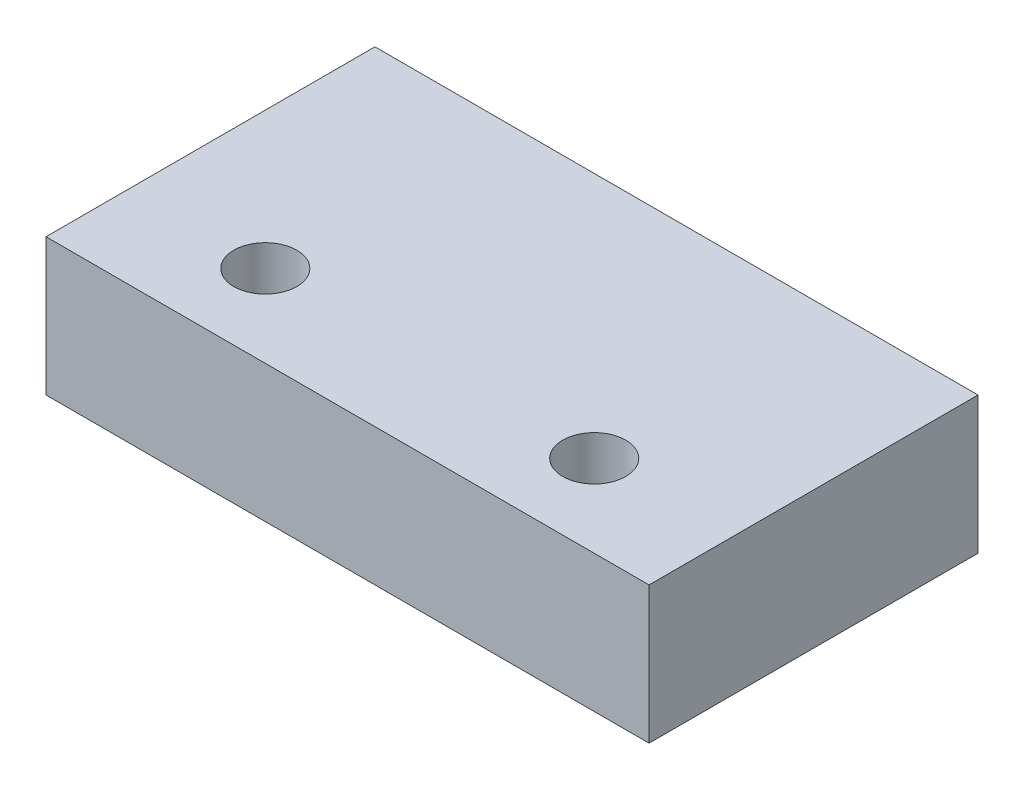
ISO-10303-21;
HEADER;
FILE_DESCRIPTION(('STEP AP214'),'2;1');
FILE_NAME('part.step','',(''),(''),'','','');
FILE_SCHEMA(('AUTOMOTIVE_DESIGN { 1 0 10303 214 1 1 1 1 }'));
ENDSEC;
DATA;
#1=APPLICATION_CONTEXT('core data for automotive mechanical design processes');
#2=APPLICATION_PROTOCOL_DEFINITION('international standard','automotive_design',2000,#1);
#3=PRODUCT_CONTEXT('',#1,'mechanical');
#4=PRODUCT('Part','Part','',(#3));
#5=PRODUCT_RELATED_PRODUCT_CATEGORY('part','',(#4));
#6=PRODUCT_DEFINITION_FORMATION('','',#4);
#7=PRODUCT_DEFINITION_CONTEXT('part definition',#1,'design');
#8=PRODUCT_DEFINITION('design','',#6,#7);
#9=PRODUCT_DEFINITION_SHAPE('','',#8);
#10=(LENGTH_UNIT() NAMED_UNIT(*) SI_UNIT(.MILLI.,.METRE.));
#11=(NAMED_UNIT(*) PLANE_ANGLE_UNIT() SI_UNIT($,.RADIAN.));
#12=(NAMED_UNIT(*) SI_UNIT($,.STERADIAN.) SOLID_ANGLE_UNIT());
#13=UNCERTAINTY_MEASURE_WITH_UNIT(LENGTH_MEASURE(1.E-05),#10,'distance_accuracy_value','');
#14=(GEOMETRIC_REPRESENTATION_CONTEXT(3) GLOBAL_UNCERTAINTY_ASSIGNED_CONTEXT((#13)) GLOBAL_UNIT_ASSIGNED_CONTEXT((#10,
#11,#12)) REPRESENTATION_CONTEXT('',''));
#15=CARTESIAN_POINT('',(0.,0.,0.));
#16=DIRECTION('',(0.,0.,1.));
#17=DIRECTION('',(1.,0.,0.));
#18=AXIS2_PLACEMENT_3D('',#15,#16,#17);
#19=CARTESIAN_POINT('',(0.,5.,0.));
#20=DIRECTION('',(0.,1.,0.));
#21=DIRECTION('',(0.,0.,1.));
#22=AXIS2_PLACEMENT_3D('',#19,#20,#21);
#23=PLANE('',#22);
#24=CARTESIAN_POINT('',(-5.99999999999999,5.,9.));
#25=DIRECTION('',(0.,1.,0.));
#26=DIRECTION('',(0.,0.,1.));
#27=AXIS2_PLACEMENT_3D('',#24,#25,#26);
#28=CIRCLE('',#27,1.15);
#29=CARTESIAN_POINT('',(-5.99999999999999,5.,10.15));
#30=VERTEX_POINT('',#29);
#31=EDGE_CURVE('E100',#30,#30,#28,.T.);
#32=ORIENTED_EDGE('',*,*,#31,.F.);
#33=EDGE_LOOP('',(#32));
#34=FACE_BOUND('',#33,.T.);
#35=DIRECTION('',(0.,0.,1.));
#36=VECTOR('',#35,1.);
#37=CARTESIAN_POINT('',(-11.,5.,0.));
#38=LINE('',#37,#36);
#39=CARTESIAN_POINT('',(-11.,5.,0.));
#40=VERTEX_POINT('',#39);
#41=CARTESIAN_POINT('',(-11.,5.,12.));
#42=VERTEX_POINT('',#41);
#43=EDGE_CURVE('E85',#40,#42,#38,.T.);
#44=ORIENTED_EDGE('',*,*,#43,.T.);
#45=DIRECTION('',(1.,0.,0.));
#46=VECTOR('',#45,1.);
#47=CARTESIAN_POINT('',(-11.,5.,12.));
#48=LINE('',#47,#46);
#49=CARTESIAN_POINT('',(11.,5.,12.));
#50=VERTEX_POINT('',#49);
#51=EDGE_CURVE('E80',#42,#50,#48,.T.);
#52=ORIENTED_EDGE('',*,*,#51,.T.);
#53=DIRECTION('',(0.,0.,-1.));
#54=VECTOR('',#53,1.);
#55=CARTESIAN_POINT('',(11.,5.,0.));
#56=LINE('',#55,#54);
#57=CARTESIAN_POINT('',(11.,5.,0.));
#58=VERTEX_POINT('',#57);
#59=EDGE_CURVE('E83',#50,#58,#56,.T.);
#60=ORIENTED_EDGE('',*,*,#59,.T.);
#61=DIRECTION('',(-1.,0.,0.));
#62=VECTOR('',#61,1.);
#63=CARTESIAN_POINT('',(-11.,5.,0.));
#64=LINE('',#63,#62);
#65=EDGE_CURVE('E50',#58,#40,#64,.T.);
#66=ORIENTED_EDGE('',*,*,#65,.T.);
#67=EDGE_LOOP('',(#44,#52,#60,#66));
#68=FACE_BOUND('',#67,.T.);
#69=CARTESIAN_POINT('',(6.00000000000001,5.,9.));
#70=DIRECTION('',(0.,1.,0.));
#71=DIRECTION('',(0.,0.,-1.));
#72=AXIS2_PLACEMENT_3D('',#69,#70,#71);
#73=CIRCLE('',#72,1.15);
#74=CARTESIAN_POINT('',(6.00000000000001,5.,7.85));
#75=VERTEX_POINT('',#74);
#76=EDGE_CURVE('E115',#75,#75,#73,.T.);
#77=ORIENTED_EDGE('',*,*,#76,.F.);
#78=EDGE_LOOP('',(#77));
#79=FACE_BOUND('',#78,.T.);
#80=ADVANCED_FACE('F33',(#34,#68,#79),#23,.T.);
#81=CARTESIAN_POINT('',(0.,0.,0.));
#82=DIRECTION('',(0.,1.,0.));
#83=DIRECTION('',(0.,0.,1.));
#84=AXIS2_PLACEMENT_3D('',#81,#82,#83);
#85=PLANE('',#84);
#86=CARTESIAN_POINT('',(-5.99999999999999,0.,9.));
#87=DIRECTION('',(0.,1.,0.));
#88=DIRECTION('',(0.,0.,1.));
#89=AXIS2_PLACEMENT_3D('',#86,#87,#88);
#90=CIRCLE('',#89,1.15);
#91=CARTESIAN_POINT('',(-5.99999999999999,0.,10.15));
#92=VERTEX_POINT('',#91);
#93=EDGE_CURVE('E112',#92,#92,#90,.T.);
#94=ORIENTED_EDGE('',*,*,#93,.T.);
#95=EDGE_LOOP('',(#94));
#96=FACE_BOUND('',#95,.T.);
#97=DIRECTION('',(0.,0.,1.));
#98=VECTOR('',#97,1.);
#99=CARTESIAN_POINT('',(-11.,0.,0.));
#100=LINE('',#99,#98);
#101=CARTESIAN_POINT('',(-11.,0.,0.));
#102=VERTEX_POINT('',#101);
#103=CARTESIAN_POINT('',(-11.,0.,12.));
#104=VERTEX_POINT('',#103);
#105=EDGE_CURVE('E97',#102,#104,#100,.T.);
#106=ORIENTED_EDGE('',*,*,#105,.F.);
#107=DIRECTION('',(-1.,0.,0.));
#108=VECTOR('',#107,1.);
#109=CARTESIAN_POINT('',(-11.,0.,0.));
#110=LINE('',#109,#108);
#111=CARTESIAN_POINT('',(11.,0.,0.));
#112=VERTEX_POINT('',#111);
#113=EDGE_CURVE('E73',#112,#102,#110,.T.);
#114=ORIENTED_EDGE('',*,*,#113,.F.);
#115=DIRECTION('',(0.,0.,-1.));
#116=VECTOR('',#115,1.);
#117=CARTESIAN_POINT('',(11.,0.,0.));
#118=LINE('',#117,#116);
#119=CARTESIAN_POINT('',(11.,0.,12.));
#120=VERTEX_POINT('',#119);
#121=EDGE_CURVE('E67',#120,#112,#118,.T.);
#122=ORIENTED_EDGE('',*,*,#121,.F.);
#123=DIRECTION('',(1.,0.,0.));
#124=VECTOR('',#123,1.);
#125=CARTESIAN_POINT('',(-11.,0.,12.));
#126=LINE('',#125,#124);
#127=EDGE_CURVE('E89',#104,#120,#126,.T.);
#128=ORIENTED_EDGE('',*,*,#127,.F.);
#129=EDGE_LOOP('',(#106,#114,#122,#128));
#130=FACE_BOUND('',#129,.T.);
#131=CARTESIAN_POINT('',(6.00000000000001,0.,9.));
#132=DIRECTION('',(0.,1.,0.));
#133=DIRECTION('',(0.,0.,-1.));
#134=AXIS2_PLACEMENT_3D('',#131,#132,#133);
#135=CIRCLE('',#134,1.15);
#136=CARTESIAN_POINT('',(6.00000000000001,0.,7.85));
#137=VERTEX_POINT('',#136);
#138=EDGE_CURVE('E118',#137,#137,#135,.T.);
#139=ORIENTED_EDGE('',*,*,#138,.T.);
#140=EDGE_LOOP('',(#139));
#141=FACE_BOUND('',#140,.T.);
#142=ADVANCED_FACE('F108',(#96,#130,#141),#85,.F.);
#143=CARTESIAN_POINT('',(-11.,5.,0.));
#144=DIRECTION('',(1.,0.,0.));
#145=DIRECTION('',(0.,0.,-1.));
#146=AXIS2_PLACEMENT_3D('',#143,#144,#145);
#147=PLANE('',#146);
#148=ORIENTED_EDGE('',*,*,#105,.T.);
#149=DIRECTION('',(0.,-1.,0.));
#150=VECTOR('',#149,1.);
#151=CARTESIAN_POINT('',(-11.,5.,12.));
#152=LINE('',#151,#150);
#153=EDGE_CURVE('E11',#42,#104,#152,.T.);
#154=ORIENTED_EDGE('',*,*,#153,.F.);
#155=ORIENTED_EDGE('',*,*,#43,.F.);
#156=DIRECTION('',(0.,-1.,0.));
#157=VECTOR('',#156,1.);
#158=CARTESIAN_POINT('',(-11.,5.,0.));
#159=LINE('',#158,#157);
#160=EDGE_CURVE('E93',#40,#102,#159,.T.);
#161=ORIENTED_EDGE('',*,*,#160,.T.);
#162=EDGE_LOOP('',(#148,#154,#155,#161));
#163=FACE_BOUND('',#162,.T.);
#164=ADVANCED_FACE('F35',(#163),#147,.F.);
#165=CARTESIAN_POINT('',(-11.,5.,12.));
#166=DIRECTION('',(0.,0.,-1.));
#167=DIRECTION('',(-1.,0.,0.));
#168=AXIS2_PLACEMENT_3D('',#165,#166,#167);
#169=PLANE('',#168);
#170=ORIENTED_EDGE('',*,*,#127,.T.);
#171=DIRECTION('',(0.,-1.,0.));
#172=VECTOR('',#171,1.);
#173=CARTESIAN_POINT('',(11.,5.,12.));
#174=LINE('',#173,#172);
#175=EDGE_CURVE('E42',#50,#120,#174,.T.);
#176=ORIENTED_EDGE('',*,*,#175,.F.);
#177=ORIENTED_EDGE('',*,*,#51,.F.);
#178=ORIENTED_EDGE('',*,*,#153,.T.);
#179=EDGE_LOOP('',(#170,#176,#177,#178));
#180=FACE_BOUND('',#179,.T.);
#181=ADVANCED_FACE('F88',(#180),#169,.F.);
#182=CARTESIAN_POINT('',(11.,5.,0.));
#183=DIRECTION('',(-1.,0.,0.));
#184=DIRECTION('',(0.,0.,1.));
#185=AXIS2_PLACEMENT_3D('',#182,#183,#184);
#186=PLANE('',#185);
#187=ORIENTED_EDGE('',*,*,#121,.T.);
#188=DIRECTION('',(0.,-1.,0.));
#189=VECTOR('',#188,1.);
#190=CARTESIAN_POINT('',(11.,5.,0.));
#191=LINE('',#190,#189);
#192=EDGE_CURVE('E90',#58,#112,#191,.T.);
#193=ORIENTED_EDGE('',*,*,#192,.F.);
#194=ORIENTED_EDGE('',*,*,#59,.F.);
#195=ORIENTED_EDGE('',*,*,#175,.T.);
#196=EDGE_LOOP('',(#187,#193,#194,#195));
#197=FACE_BOUND('',#196,.T.);
#198=ADVANCED_FACE('F91',(#197),#186,.F.);
#199=CARTESIAN_POINT('',(-11.,5.,0.));
#200=DIRECTION('',(0.,0.,1.));
#201=DIRECTION('',(1.,0.,0.));
#202=AXIS2_PLACEMENT_3D('',#199,#200,#201);
#203=PLANE('',#202);
#204=ORIENTED_EDGE('',*,*,#113,.T.);
#205=ORIENTED_EDGE('',*,*,#160,.F.);
#206=ORIENTED_EDGE('',*,*,#65,.F.);
#207=ORIENTED_EDGE('',*,*,#192,.T.);
#208=EDGE_LOOP('',(#204,#205,#206,#207));
#209=FACE_BOUND('',#208,.T.);
#210=ADVANCED_FACE('F105',(#209),#203,.F.);
#211=CARTESIAN_POINT('',(-5.99999999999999,5.,9.));
#212=DIRECTION('',(0.,-1.,0.));
#213=DIRECTION('',(0.,0.,-1.));
#214=AXIS2_PLACEMENT_3D('',#211,#212,#213);
#215=CYLINDRICAL_SURFACE('',#214,1.15);
#216=ORIENTED_EDGE('',*,*,#31,.T.);
#217=EDGE_LOOP('',(#216));
#218=FACE_BOUND('',#217,.T.);
#219=ORIENTED_EDGE('',*,*,#93,.F.);
#220=EDGE_LOOP('',(#219));
#221=FACE_BOUND('',#220,.T.);
#222=ADVANCED_FACE('F136',(#218,#221),#215,.F.);
#223=CARTESIAN_POINT('',(6.00000000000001,5.,9.));
#224=DIRECTION('',(0.,-1.,0.));
#225=DIRECTION('',(0.,0.,-1.));
#226=AXIS2_PLACEMENT_3D('',#223,#224,#225);
#227=CYLINDRICAL_SURFACE('',#226,1.15);
#228=ORIENTED_EDGE('',*,*,#76,.T.);
#229=EDGE_LOOP('',(#228));
#230=FACE_BOUND('',#229,.T.);
#231=ORIENTED_EDGE('',*,*,#138,.F.);
#232=EDGE_LOOP('',(#231));
#233=FACE_BOUND('',#232,.T.);
#234=ADVANCED_FACE('F124',(#230,#233),#227,.F.);
#235=CLOSED_SHELL('',(#80,#142,#164,#181,#198,#210,#222,#234));
#236=MANIFOLD_SOLID_BREP('B2',#235);
#237=ADVANCED_BREP_SHAPE_REPRESENTATION('',(#18,#236),#14);
#238=SHAPE_DEFINITION_REPRESENTATION(#9,#237);
ENDSEC;
END-ISO-10303-21;
